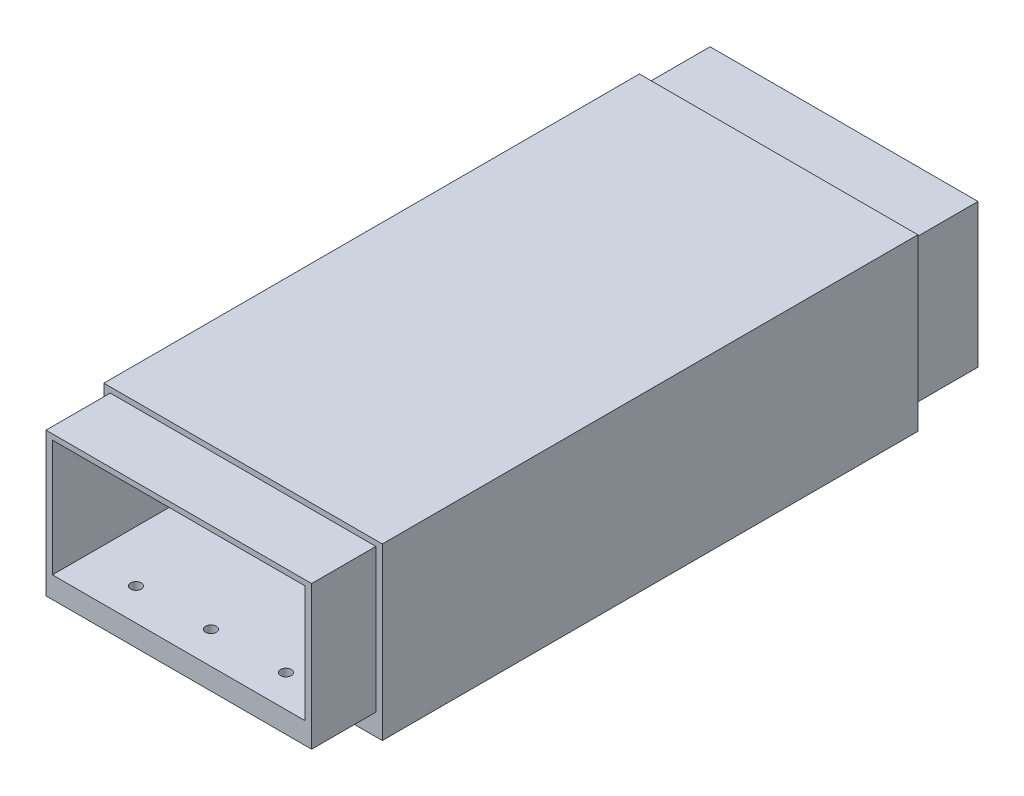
ISO-10303-21;
HEADER;
FILE_DESCRIPTION(('STEP AP214'),'2;1');
FILE_NAME('part.step','',(''),(''),'','','');
FILE_SCHEMA(('AUTOMOTIVE_DESIGN { 1 0 10303 214 1 1 1 1 }'));
ENDSEC;
DATA;
#1=APPLICATION_CONTEXT('core data for automotive mechanical design processes');
#2=APPLICATION_PROTOCOL_DEFINITION('international standard','automotive_design',2000,#1);
#3=PRODUCT_CONTEXT('',#1,'mechanical');
#4=PRODUCT('Part','Part','',(#3));
#5=PRODUCT_RELATED_PRODUCT_CATEGORY('part','',(#4));
#6=PRODUCT_DEFINITION_FORMATION('','',#4);
#7=PRODUCT_DEFINITION_CONTEXT('part definition',#1,'design');
#8=PRODUCT_DEFINITION('design','',#6,#7);
#9=PRODUCT_DEFINITION_SHAPE('','',#8);
#10=(LENGTH_UNIT() NAMED_UNIT(*) SI_UNIT(.MILLI.,.METRE.));
#11=(NAMED_UNIT(*) PLANE_ANGLE_UNIT() SI_UNIT($,.RADIAN.));
#12=(NAMED_UNIT(*) SI_UNIT($,.STERADIAN.) SOLID_ANGLE_UNIT());
#13=UNCERTAINTY_MEASURE_WITH_UNIT(LENGTH_MEASURE(1.E-05),#10,'distance_accuracy_value','');
#14=(GEOMETRIC_REPRESENTATION_CONTEXT(3) GLOBAL_UNCERTAINTY_ASSIGNED_CONTEXT((#13)) GLOBAL_UNIT_ASSIGNED_CONTEXT((#10,
#11,#12)) REPRESENTATION_CONTEXT('',''));
#15=CARTESIAN_POINT('',(0.,0.,0.));
#16=DIRECTION('',(0.,0.,1.));
#17=DIRECTION('',(1.,0.,0.));
#18=AXIS2_PLACEMENT_3D('',#15,#16,#17);
#19=CARTESIAN_POINT('',(0.,0.,1680.00000000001));
#20=DIRECTION('',(0.,0.,-1.));
#21=DIRECTION('',(-1.,0.,0.));
#22=AXIS2_PLACEMENT_3D('',#19,#20,#21);
#23=PLANE('',#22);
#24=DIRECTION('',(0.,-1.,0.));
#25=VECTOR('',#24,1.);
#26=CARTESIAN_POINT('',(-122.30239365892,63.0246653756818,1680.00000000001));
#27=LINE('',#26,#25);
#28=CARTESIAN_POINT('',(-122.30239365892,142.51739571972,1680.00000000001));
#29=VERTEX_POINT('',#28);
#30=CARTESIAN_POINT('',(-122.30239365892,63.0246653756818,1680.00000000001));
#31=VERTEX_POINT('',#30);
#32=EDGE_CURVE('E210',#29,#31,#27,.T.);
#33=ORIENTED_EDGE('',*,*,#32,.T.);
#34=DIRECTION('',(1.,0.,0.));
#35=VECTOR('',#34,1.);
#36=CARTESIAN_POINT('',(-122.30239365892,63.0246653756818,1680.00000000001));
#37=LINE('',#36,#35);
#38=CARTESIAN_POINT('',(7.69760634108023,63.0246653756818,1680.00000000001));
#39=VERTEX_POINT('',#38);
#40=EDGE_CURVE('E213',#31,#39,#37,.T.);
#41=ORIENTED_EDGE('',*,*,#40,.T.);
#42=DIRECTION('',(0.,1.,0.));
#43=VECTOR('',#42,1.);
#44=CARTESIAN_POINT('',(7.69760634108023,63.0246653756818,1680.00000000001));
#45=LINE('',#44,#43);
#46=CARTESIAN_POINT('',(7.69760634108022,142.51739571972,1680.00000000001));
#47=VERTEX_POINT('',#46);
#48=EDGE_CURVE('E216',#39,#47,#45,.T.);
#49=ORIENTED_EDGE('',*,*,#48,.T.);
#50=DIRECTION('',(-1.,0.,0.));
#51=VECTOR('',#50,1.);
#52=CARTESIAN_POINT('',(-122.30239365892,142.51739571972,1680.00000000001));
#53=LINE('',#52,#51);
#54=EDGE_CURVE('E218',#47,#29,#53,.T.);
#55=ORIENTED_EDGE('',*,*,#54,.T.);
#56=EDGE_LOOP('',(#33,#41,#49,#55));
#57=FACE_BOUND('',#56,.T.);
#58=DIRECTION('',(0.,-1.,0.));
#59=VECTOR('',#58,1.);
#60=CARTESIAN_POINT('',(-119.30239365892,140.01739571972,1680.00000000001));
#61=LINE('',#60,#59);
#62=CARTESIAN_POINT('',(-119.30239365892,140.01739571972,1680.00000000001));
#63=VERTEX_POINT('',#62);
#64=CARTESIAN_POINT('',(-119.30239365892,73.0246653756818,1680.00000000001));
#65=VERTEX_POINT('',#64);
#66=EDGE_CURVE('E54',#63,#65,#61,.T.);
#67=ORIENTED_EDGE('',*,*,#66,.F.);
#68=DIRECTION('',(-1.,0.,0.));
#69=VECTOR('',#68,1.);
#70=CARTESIAN_POINT('',(-119.30239365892,140.01739571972,1680.00000000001));
#71=LINE('',#70,#69);
#72=CARTESIAN_POINT('',(4.69760634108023,140.01739571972,1680.00000000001));
#73=VERTEX_POINT('',#72);
#74=EDGE_CURVE('E58',#73,#63,#71,.T.);
#75=ORIENTED_EDGE('',*,*,#74,.F.);
#76=DIRECTION('',(0.,1.,0.));
#77=VECTOR('',#76,1.);
#78=CARTESIAN_POINT('',(4.69760634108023,140.01739571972,1680.00000000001));
#79=LINE('',#78,#77);
#80=CARTESIAN_POINT('',(4.69760634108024,73.0246653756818,1680.00000000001));
#81=VERTEX_POINT('',#80);
#82=EDGE_CURVE('E195',#81,#73,#79,.T.);
#83=ORIENTED_EDGE('',*,*,#82,.F.);
#84=DIRECTION('',(1.,0.,0.));
#85=VECTOR('',#84,1.);
#86=CARTESIAN_POINT('',(-119.30239365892,73.0246653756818,1680.00000000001));
#87=LINE('',#86,#85);
#88=EDGE_CURVE('E192',#65,#81,#87,.T.);
#89=ORIENTED_EDGE('',*,*,#88,.F.);
#90=EDGE_LOOP('',(#67,#75,#83,#89));
#91=FACE_BOUND('',#90,.T.);
#92=ADVANCED_FACE('F39',(#57,#91),#23,.F.);
#93=CARTESIAN_POINT('',(-119.30239365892,140.01739571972,1571.88680099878));
#94=DIRECTION('',(0.,-1.,0.));
#95=DIRECTION('',(0.,0.,-1.));
#96=AXIS2_PLACEMENT_3D('',#93,#94,#95);
#97=PLANE('',#96);
#98=DIRECTION('',(-1.,0.,0.));
#99=VECTOR('',#98,1.);
#100=CARTESIAN_POINT('',(-119.30239365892,140.01739571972,1430.00000000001));
#101=LINE('',#100,#99);
#102=CARTESIAN_POINT('',(5.77293715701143,140.01739571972,1430.00000000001));
#103=VERTEX_POINT('',#102);
#104=CARTESIAN_POINT('',(-119.30239365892,140.01739571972,1430.00000000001));
#105=VERTEX_POINT('',#104);
#106=EDGE_CURVE('E239',#103,#105,#101,.T.);
#107=ORIENTED_EDGE('',*,*,#106,.F.);
#108=DIRECTION('',(0.,0.,-1.));
#109=VECTOR('',#108,1.);
#110=CARTESIAN_POINT('',(5.77293715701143,140.01739571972,1571.88680099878));
#111=LINE('',#110,#109);
#112=CARTESIAN_POINT('',(5.77293715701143,140.01739571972,1400.00000000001));
#113=VERTEX_POINT('',#112);
#114=EDGE_CURVE('E277',#103,#113,#111,.T.);
#115=ORIENTED_EDGE('',*,*,#114,.T.);
#116=DIRECTION('',(-1.,0.,0.));
#117=VECTOR('',#116,1.);
#118=CARTESIAN_POINT('',(-119.30239365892,140.01739571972,1400.00000000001));
#119=LINE('',#118,#117);
#120=CARTESIAN_POINT('',(-119.30239365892,140.01739571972,1400.00000000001));
#121=VERTEX_POINT('',#120);
#122=EDGE_CURVE('E272',#113,#121,#119,.T.);
#123=ORIENTED_EDGE('',*,*,#122,.T.);
#124=DIRECTION('',(0.,0.,-1.));
#125=VECTOR('',#124,1.);
#126=CARTESIAN_POINT('',(-119.30239365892,140.01739571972,1571.88680099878));
#127=LINE('',#126,#125);
#128=EDGE_CURVE('E275',#105,#121,#127,.T.);
#129=ORIENTED_EDGE('',*,*,#128,.F.);
#130=EDGE_LOOP('',(#107,#115,#123,#129));
#131=FACE_BOUND('',#130,.T.);
#132=ADVANCED_FACE('F293',(#131),#97,.F.);
#133=CARTESIAN_POINT('',(5.77293715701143,140.01739571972,1571.88680099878));
#134=DIRECTION('',(-1.,0.,0.));
#135=DIRECTION('',(0.,-1.,0.));
#136=AXIS2_PLACEMENT_3D('',#133,#134,#135);
#137=PLANE('',#136);
#138=DIRECTION('',(0.,1.,0.));
#139=VECTOR('',#138,1.);
#140=CARTESIAN_POINT('',(5.77293715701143,140.01739571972,1430.00000000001));
#141=LINE('',#140,#139);
#142=CARTESIAN_POINT('',(5.77293715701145,73.0246653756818,1430.00000000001));
#143=VERTEX_POINT('',#142);
#144=EDGE_CURVE('E242',#143,#103,#141,.T.);
#145=ORIENTED_EDGE('',*,*,#144,.F.);
#146=DIRECTION('',(0.,0.,-1.));
#147=VECTOR('',#146,1.);
#148=CARTESIAN_POINT('',(5.77293715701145,73.0246653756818,1571.88680099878));
#149=LINE('',#148,#147);
#150=CARTESIAN_POINT('',(5.77293715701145,73.0246653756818,1400.00000000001));
#151=VERTEX_POINT('',#150);
#152=EDGE_CURVE('E47',#143,#151,#149,.T.);
#153=ORIENTED_EDGE('',*,*,#152,.T.);
#154=DIRECTION('',(0.,1.,0.));
#155=VECTOR('',#154,1.);
#156=CARTESIAN_POINT('',(5.77293715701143,140.01739571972,1400.00000000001));
#157=LINE('',#156,#155);
#158=EDGE_CURVE('E269',#151,#113,#157,.T.);
#159=ORIENTED_EDGE('',*,*,#158,.T.);
#160=ORIENTED_EDGE('',*,*,#114,.F.);
#161=EDGE_LOOP('',(#145,#153,#159,#160));
#162=FACE_BOUND('',#161,.T.);
#163=ADVANCED_FACE('F280',(#162),#137,.F.);
#164=CARTESIAN_POINT('',(-119.30239365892,73.0246653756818,1571.88680099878));
#165=DIRECTION('',(0.,1.,0.));
#166=DIRECTION('',(0.,0.,1.));
#167=AXIS2_PLACEMENT_3D('',#164,#165,#166);
#168=PLANE('',#167);
#169=CARTESIAN_POINT('',(-92.3023936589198,73.0246653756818,1415.00000000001));
#170=DIRECTION('',(0.,-1.,0.));
#171=DIRECTION('',(0.,0.,-1.));
#172=AXIS2_PLACEMENT_3D('',#169,#170,#171);
#173=CIRCLE('',#172,2.49999999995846);
#174=CARTESIAN_POINT('',(-92.3023936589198,73.0246653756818,1412.50000000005));
#175=VERTEX_POINT('',#174);
#176=EDGE_CURVE('E170',#175,#175,#173,.T.);
#177=ORIENTED_EDGE('',*,*,#176,.F.);
#178=EDGE_LOOP('',(#177));
#179=FACE_BOUND('',#178,.T.);
#180=CARTESIAN_POINT('',(-57.3023936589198,73.0246653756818,1415.00000000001));
#181=DIRECTION('',(0.,-1.,0.));
#182=DIRECTION('',(0.,0.,-1.));
#183=AXIS2_PLACEMENT_3D('',#180,#181,#182);
#184=CIRCLE('',#183,2.49999999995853);
#185=CARTESIAN_POINT('',(-57.3023936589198,73.0246653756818,1412.50000000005));
#186=VERTEX_POINT('',#185);
#187=EDGE_CURVE('E598',#186,#186,#184,.T.);
#188=ORIENTED_EDGE('',*,*,#187,.F.);
#189=EDGE_LOOP('',(#188));
#190=FACE_BOUND('',#189,.T.);
#191=CARTESIAN_POINT('',(-22.3023936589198,73.0246653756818,1415.00000000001));
#192=DIRECTION('',(0.,-1.,0.));
#193=DIRECTION('',(0.,0.,-1.));
#194=AXIS2_PLACEMENT_3D('',#191,#192,#193);
#195=CIRCLE('',#194,2.49999999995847);
#196=CARTESIAN_POINT('',(-22.3023936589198,73.0246653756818,1412.50000000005));
#197=VERTEX_POINT('',#196);
#198=EDGE_CURVE('E572',#197,#197,#195,.T.);
#199=ORIENTED_EDGE('',*,*,#198,.F.);
#200=EDGE_LOOP('',(#199));
#201=FACE_BOUND('',#200,.T.);
#202=DIRECTION('',(1.,0.,0.));
#203=VECTOR('',#202,1.);
#204=CARTESIAN_POINT('',(-119.30239365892,73.0246653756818,1430.00000000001));
#205=LINE('',#204,#203);
#206=CARTESIAN_POINT('',(-119.30239365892,73.0246653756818,1430.00000000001));
#207=VERTEX_POINT('',#206);
#208=EDGE_CURVE('E245',#207,#143,#205,.T.);
#209=ORIENTED_EDGE('',*,*,#208,.F.);
#210=DIRECTION('',(0.,0.,-1.));
#211=VECTOR('',#210,1.);
#212=CARTESIAN_POINT('',(-119.30239365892,73.0246653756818,1571.88680099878));
#213=LINE('',#212,#211);
#214=CARTESIAN_POINT('',(-119.30239365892,73.0246653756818,1400.00000000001));
#215=VERTEX_POINT('',#214);
#216=EDGE_CURVE('E11',#207,#215,#213,.T.);
#217=ORIENTED_EDGE('',*,*,#216,.T.);
#218=DIRECTION('',(1.,0.,0.));
#219=VECTOR('',#218,1.);
#220=CARTESIAN_POINT('',(-119.30239365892,73.0246653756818,1400.00000000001));
#221=LINE('',#220,#219);
#222=EDGE_CURVE('E266',#215,#151,#221,.T.);
#223=ORIENTED_EDGE('',*,*,#222,.T.);
#224=ORIENTED_EDGE('',*,*,#152,.F.);
#225=EDGE_LOOP('',(#209,#217,#223,#224));
#226=FACE_BOUND('',#225,.T.);
#227=ADVANCED_FACE('F286',(#179,#190,#201,#226),#168,.F.);
#228=CARTESIAN_POINT('',(-119.30239365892,140.01739571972,1571.88680099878));
#229=DIRECTION('',(1.,0.,0.));
#230=DIRECTION('',(0.,1.,0.));
#231=AXIS2_PLACEMENT_3D('',#228,#229,#230);
#232=PLANE('',#231);
#233=DIRECTION('',(0.,-1.,0.));
#234=VECTOR('',#233,1.);
#235=CARTESIAN_POINT('',(-119.30239365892,140.01739571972,1430.00000000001));
#236=LINE('',#235,#234);
#237=EDGE_CURVE('E248',#105,#207,#236,.T.);
#238=ORIENTED_EDGE('',*,*,#237,.F.);
#239=ORIENTED_EDGE('',*,*,#128,.T.);
#240=DIRECTION('',(0.,-1.,0.));
#241=VECTOR('',#240,1.);
#242=CARTESIAN_POINT('',(-119.30239365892,140.01739571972,1400.00000000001));
#243=LINE('',#242,#241);
#244=EDGE_CURVE('E160',#121,#215,#243,.T.);
#245=ORIENTED_EDGE('',*,*,#244,.T.);
#246=ORIENTED_EDGE('',*,*,#216,.F.);
#247=EDGE_LOOP('',(#238,#239,#245,#246));
#248=FACE_BOUND('',#247,.T.);
#249=ADVANCED_FACE('F41',(#248),#232,.F.);
#250=CARTESIAN_POINT('',(0.,0.,1400.00000000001));
#251=DIRECTION('',(0.,0.,1.));
#252=DIRECTION('',(1.,0.,0.));
#253=AXIS2_PLACEMENT_3D('',#250,#251,#252);
#254=PLANE('',#253);
#255=ORIENTED_EDGE('',*,*,#244,.F.);
#256=ORIENTED_EDGE('',*,*,#122,.F.);
#257=ORIENTED_EDGE('',*,*,#158,.F.);
#258=ORIENTED_EDGE('',*,*,#222,.F.);
#259=EDGE_LOOP('',(#255,#256,#257,#258));
#260=FACE_BOUND('',#259,.T.);
#261=DIRECTION('',(0.,-1.,0.));
#262=VECTOR('',#261,1.);
#263=CARTESIAN_POINT('',(-116.30239365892,137.51739571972,1400.00000000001));
#264=LINE('',#263,#262);
#265=CARTESIAN_POINT('',(-116.30239365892,137.51739571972,1400.00000000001));
#266=VERTEX_POINT('',#265);
#267=CARTESIAN_POINT('',(-116.30239365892,83.0246653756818,1400.00000000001));
#268=VERTEX_POINT('',#267);
#269=EDGE_CURVE('E251',#266,#268,#264,.T.);
#270=ORIENTED_EDGE('',*,*,#269,.T.);
#271=DIRECTION('',(1.,0.,0.));
#272=VECTOR('',#271,1.);
#273=CARTESIAN_POINT('',(-116.30239365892,83.0246653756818,1400.00000000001));
#274=LINE('',#273,#272);
#275=CARTESIAN_POINT('',(1.69760634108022,83.0246653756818,1400.00000000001));
#276=VERTEX_POINT('',#275);
#277=EDGE_CURVE('E156',#268,#276,#274,.T.);
#278=ORIENTED_EDGE('',*,*,#277,.T.);
#279=DIRECTION('',(0.,1.,0.));
#280=VECTOR('',#279,1.);
#281=CARTESIAN_POINT('',(1.69760634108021,137.51739571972,1400.00000000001));
#282=LINE('',#281,#280);
#283=CARTESIAN_POINT('',(1.69760634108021,137.51739571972,1400.00000000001));
#284=VERTEX_POINT('',#283);
#285=EDGE_CURVE('E254',#276,#284,#282,.T.);
#286=ORIENTED_EDGE('',*,*,#285,.T.);
#287=DIRECTION('',(-1.,0.,0.));
#288=VECTOR('',#287,1.);
#289=CARTESIAN_POINT('',(-116.30239365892,137.51739571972,1400.00000000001));
#290=LINE('',#289,#288);
#291=EDGE_CURVE('E257',#284,#266,#290,.T.);
#292=ORIENTED_EDGE('',*,*,#291,.T.);
#293=EDGE_LOOP('',(#270,#278,#286,#292));
#294=FACE_BOUND('',#293,.T.);
#295=ADVANCED_FACE('F290',(#260,#294),#254,.F.);
#296=CARTESIAN_POINT('',(-116.30239365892,137.51739571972,1571.88680099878));
#297=DIRECTION('',(0.,-1.,0.));
#298=DIRECTION('',(0.,0.,-1.));
#299=AXIS2_PLACEMENT_3D('',#296,#297,#298);
#300=PLANE('',#299);
#301=DIRECTION('',(0.,0.,-1.));
#302=VECTOR('',#301,1.);
#303=CARTESIAN_POINT('',(1.69760634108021,137.51739571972,1571.88680099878));
#304=LINE('',#303,#302);
#305=CARTESIAN_POINT('',(1.6976063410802,137.51739571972,1710.00000000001));
#306=VERTEX_POINT('',#305);
#307=EDGE_CURVE('E261',#306,#284,#304,.T.);
#308=ORIENTED_EDGE('',*,*,#307,.F.);
#309=DIRECTION('',(-1.,0.,0.));
#310=VECTOR('',#309,1.);
#311=CARTESIAN_POINT('',(-116.30239365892,137.51739571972,1710.00000000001));
#312=LINE('',#311,#310);
#313=CARTESIAN_POINT('',(-116.30239365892,137.51739571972,1710.00000000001));
#314=VERTEX_POINT('',#313);
#315=EDGE_CURVE('E176',#306,#314,#312,.T.);
#316=ORIENTED_EDGE('',*,*,#315,.T.);
#317=DIRECTION('',(0.,0.,-1.));
#318=VECTOR('',#317,1.);
#319=CARTESIAN_POINT('',(-116.30239365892,137.51739571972,1571.88680099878));
#320=LINE('',#319,#318);
#321=EDGE_CURVE('E166',#314,#266,#320,.T.);
#322=ORIENTED_EDGE('',*,*,#321,.T.);
#323=ORIENTED_EDGE('',*,*,#291,.F.);
#324=EDGE_LOOP('',(#308,#316,#322,#323));
#325=FACE_BOUND('',#324,.T.);
#326=ADVANCED_FACE('F305',(#325),#300,.T.);
#327=CARTESIAN_POINT('',(1.69760634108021,137.51739571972,1571.88680099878));
#328=DIRECTION('',(-1.,0.,0.));
#329=DIRECTION('',(0.,-1.,0.));
#330=AXIS2_PLACEMENT_3D('',#327,#328,#329);
#331=PLANE('',#330);
#332=DIRECTION('',(0.,0.,-1.));
#333=VECTOR('',#332,1.);
#334=CARTESIAN_POINT('',(1.69760634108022,83.0246653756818,1571.88680099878));
#335=LINE('',#334,#333);
#336=CARTESIAN_POINT('',(1.6976063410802,83.0246653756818,1710.00000000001));
#337=VERTEX_POINT('',#336);
#338=EDGE_CURVE('E161',#337,#276,#335,.T.);
#339=ORIENTED_EDGE('',*,*,#338,.F.);
#340=DIRECTION('',(0.,1.,0.));
#341=VECTOR('',#340,1.);
#342=CARTESIAN_POINT('',(1.6976063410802,137.51739571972,1710.00000000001));
#343=LINE('',#342,#341);
#344=EDGE_CURVE('E174',#337,#306,#343,.T.);
#345=ORIENTED_EDGE('',*,*,#344,.T.);
#346=ORIENTED_EDGE('',*,*,#307,.T.);
#347=ORIENTED_EDGE('',*,*,#285,.F.);
#348=EDGE_LOOP('',(#339,#345,#346,#347));
#349=FACE_BOUND('',#348,.T.);
#350=ADVANCED_FACE('F339',(#349),#331,.T.);
#351=CARTESIAN_POINT('',(-116.30239365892,83.0246653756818,1571.88680099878));
#352=DIRECTION('',(0.,1.,0.));
#353=DIRECTION('',(0.,0.,1.));
#354=AXIS2_PLACEMENT_3D('',#351,#352,#353);
#355=PLANE('',#354);
#356=CARTESIAN_POINT('',(-92.3023936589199,83.0246653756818,1695.00000000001));
#357=DIRECTION('',(0.,1.,0.));
#358=DIRECTION('',(0.,0.,1.));
#359=AXIS2_PLACEMENT_3D('',#356,#357,#358);
#360=CIRCLE('',#359,2.49999999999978);
#361=CARTESIAN_POINT('',(-92.3023936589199,83.0246653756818,1697.50000000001));
#362=VERTEX_POINT('',#361);
#363=EDGE_CURVE('E568',#362,#362,#360,.F.);
#364=ORIENTED_EDGE('',*,*,#363,.T.);
#365=EDGE_LOOP('',(#364));
#366=FACE_BOUND('',#365,.T.);
#367=CARTESIAN_POINT('',(-57.3023936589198,83.0246653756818,1695.00000000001));
#368=DIRECTION('',(0.,1.,0.));
#369=DIRECTION('',(0.,0.,1.));
#370=AXIS2_PLACEMENT_3D('',#367,#368,#369);
#371=CIRCLE('',#370,2.50000000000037);
#372=CARTESIAN_POINT('',(-57.3023936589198,83.0246653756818,1697.50000000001));
#373=VERTEX_POINT('',#372);
#374=EDGE_CURVE('E576',#373,#373,#371,.F.);
#375=ORIENTED_EDGE('',*,*,#374,.T.);
#376=EDGE_LOOP('',(#375));
#377=FACE_BOUND('',#376,.T.);
#378=CARTESIAN_POINT('',(-22.3023936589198,83.0246653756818,1695.00000000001));
#379=DIRECTION('',(0.,1.,0.));
#380=DIRECTION('',(0.,0.,1.));
#381=AXIS2_PLACEMENT_3D('',#378,#379,#380);
#382=CIRCLE('',#381,2.49999999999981);
#383=CARTESIAN_POINT('',(-22.3023936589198,83.0246653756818,1697.50000000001));
#384=VERTEX_POINT('',#383);
#385=EDGE_CURVE('E582',#384,#384,#382,.F.);
#386=ORIENTED_EDGE('',*,*,#385,.T.);
#387=EDGE_LOOP('',(#386));
#388=FACE_BOUND('',#387,.T.);
#389=CARTESIAN_POINT('',(-92.3023936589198,83.0246653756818,1415.00000000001));
#390=DIRECTION('',(0.,1.,0.));
#391=DIRECTION('',(0.,0.,1.));
#392=AXIS2_PLACEMENT_3D('',#389,#390,#391);
#393=CIRCLE('',#392,2.49999999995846);
#394=CARTESIAN_POINT('',(-92.3023936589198,83.0246653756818,1417.49999999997));
#395=VERTEX_POINT('',#394);
#396=EDGE_CURVE('E592',#395,#395,#393,.F.);
#397=ORIENTED_EDGE('',*,*,#396,.T.);
#398=EDGE_LOOP('',(#397));
#399=FACE_BOUND('',#398,.T.);
#400=CARTESIAN_POINT('',(-57.3023936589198,83.0246653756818,1415.00000000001));
#401=DIRECTION('',(0.,1.,0.));
#402=DIRECTION('',(0.,0.,1.));
#403=AXIS2_PLACEMENT_3D('',#400,#401,#402);
#404=CIRCLE('',#403,2.49999999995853);
#405=CARTESIAN_POINT('',(-57.3023936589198,83.0246653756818,1417.49999999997));
#406=VERTEX_POINT('',#405);
#407=EDGE_CURVE('E595',#406,#406,#404,.F.);
#408=ORIENTED_EDGE('',*,*,#407,.T.);
#409=EDGE_LOOP('',(#408));
#410=FACE_BOUND('',#409,.T.);
#411=CARTESIAN_POINT('',(-22.3023936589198,83.0246653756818,1415.00000000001));
#412=DIRECTION('',(0.,1.,0.));
#413=DIRECTION('',(0.,0.,1.));
#414=AXIS2_PLACEMENT_3D('',#411,#412,#413);
#415=CIRCLE('',#414,2.49999999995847);
#416=CARTESIAN_POINT('',(-22.3023936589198,83.0246653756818,1417.49999999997));
#417=VERTEX_POINT('',#416);
#418=EDGE_CURVE('E575',#417,#417,#415,.F.);
#419=ORIENTED_EDGE('',*,*,#418,.T.);
#420=EDGE_LOOP('',(#419));
#421=FACE_BOUND('',#420,.T.);
#422=DIRECTION('',(0.,0.,-1.));
#423=VECTOR('',#422,1.);
#424=CARTESIAN_POINT('',(-116.30239365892,83.0246653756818,1571.88680099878));
#425=LINE('',#424,#423);
#426=CARTESIAN_POINT('',(-116.30239365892,83.0246653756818,1710.00000000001));
#427=VERTEX_POINT('',#426);
#428=EDGE_CURVE('E149',#427,#268,#425,.T.);
#429=ORIENTED_EDGE('',*,*,#428,.F.);
#430=DIRECTION('',(1.,0.,0.));
#431=VECTOR('',#430,1.);
#432=CARTESIAN_POINT('',(-116.30239365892,83.0246653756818,1710.00000000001));
#433=LINE('',#432,#431);
#434=EDGE_CURVE('E153',#427,#337,#433,.T.);
#435=ORIENTED_EDGE('',*,*,#434,.T.);
#436=ORIENTED_EDGE('',*,*,#338,.T.);
#437=ORIENTED_EDGE('',*,*,#277,.F.);
#438=EDGE_LOOP('',(#429,#435,#436,#437));
#439=FACE_BOUND('',#438,.T.);
#440=ADVANCED_FACE('F151',(#366,#377,#388,#399,#410,#421,#439),#355,.T.);
#441=CARTESIAN_POINT('',(-116.30239365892,137.51739571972,1571.88680099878));
#442=DIRECTION('',(1.,0.,0.));
#443=DIRECTION('',(0.,0.,-1.));
#444=AXIS2_PLACEMENT_3D('',#441,#442,#443);
#445=PLANE('',#444);
#446=ORIENTED_EDGE('',*,*,#321,.F.);
#447=DIRECTION('',(0.,-1.,0.));
#448=VECTOR('',#447,1.);
#449=CARTESIAN_POINT('',(-116.30239365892,137.51739571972,1710.00000000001));
#450=LINE('',#449,#448);
#451=EDGE_CURVE('E164',#314,#427,#450,.T.);
#452=ORIENTED_EDGE('',*,*,#451,.T.);
#453=ORIENTED_EDGE('',*,*,#428,.T.);
#454=ORIENTED_EDGE('',*,*,#269,.F.);
#455=EDGE_LOOP('',(#446,#452,#453,#454));
#456=FACE_BOUND('',#455,.T.);
#457=ADVANCED_FACE('F165',(#456),#445,.T.);
#458=CARTESIAN_POINT('',(0.,0.,1430.00000000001));
#459=DIRECTION('',(0.,0.,-1.));
#460=DIRECTION('',(-1.,0.,0.));
#461=AXIS2_PLACEMENT_3D('',#458,#459,#460);
#462=PLANE('',#461);
#463=ORIENTED_EDGE('',*,*,#144,.T.);
#464=ORIENTED_EDGE('',*,*,#106,.T.);
#465=ORIENTED_EDGE('',*,*,#237,.T.);
#466=ORIENTED_EDGE('',*,*,#208,.T.);
#467=EDGE_LOOP('',(#463,#464,#465,#466));
#468=FACE_BOUND('',#467,.T.);
#469=DIRECTION('',(0.,-1.,0.));
#470=VECTOR('',#469,1.);
#471=CARTESIAN_POINT('',(-122.30239365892,63.0246653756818,1430.00000000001));
#472=LINE('',#471,#470);
#473=CARTESIAN_POINT('',(-122.30239365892,142.51739571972,1430.00000000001));
#474=VERTEX_POINT('',#473);
#475=CARTESIAN_POINT('',(-122.30239365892,63.0246653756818,1430.00000000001));
#476=VERTEX_POINT('',#475);
#477=EDGE_CURVE('E209',#474,#476,#472,.T.);
#478=ORIENTED_EDGE('',*,*,#477,.F.);
#479=DIRECTION('',(-1.,0.,0.));
#480=VECTOR('',#479,1.);
#481=CARTESIAN_POINT('',(-122.30239365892,142.51739571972,1430.00000000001));
#482=LINE('',#481,#480);
#483=CARTESIAN_POINT('',(7.69760634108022,142.51739571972,1430.00000000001));
#484=VERTEX_POINT('',#483);
#485=EDGE_CURVE('E214',#484,#474,#482,.T.);
#486=ORIENTED_EDGE('',*,*,#485,.F.);
#487=DIRECTION('',(0.,1.,0.));
#488=VECTOR('',#487,1.);
#489=CARTESIAN_POINT('',(7.69760634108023,63.0246653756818,1430.00000000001));
#490=LINE('',#489,#488);
#491=CARTESIAN_POINT('',(7.69760634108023,63.0246653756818,1430.00000000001));
#492=VERTEX_POINT('',#491);
#493=EDGE_CURVE('E225',#492,#484,#490,.T.);
#494=ORIENTED_EDGE('',*,*,#493,.F.);
#495=DIRECTION('',(1.,0.,0.));
#496=VECTOR('',#495,1.);
#497=CARTESIAN_POINT('',(-122.30239365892,63.0246653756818,1430.00000000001));
#498=LINE('',#497,#496);
#499=EDGE_CURVE('E223',#476,#492,#498,.T.);
#500=ORIENTED_EDGE('',*,*,#499,.F.);
#501=EDGE_LOOP('',(#478,#486,#494,#500));
#502=FACE_BOUND('',#501,.T.);
#503=ADVANCED_FACE('F296',(#468,#502),#462,.T.);
#504=CARTESIAN_POINT('',(-122.30239365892,142.51739571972,1680.00000000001));
#505=DIRECTION('',(0.,-1.,0.));
#506=DIRECTION('',(0.,0.,-1.));
#507=AXIS2_PLACEMENT_3D('',#504,#505,#506);
#508=PLANE('',#507);
#509=ORIENTED_EDGE('',*,*,#485,.T.);
#510=DIRECTION('',(0.,0.,-1.));
#511=VECTOR('',#510,1.);
#512=CARTESIAN_POINT('',(-122.30239365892,142.51739571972,1680.00000000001));
#513=LINE('',#512,#511);
#514=EDGE_CURVE('E220',#29,#474,#513,.T.);
#515=ORIENTED_EDGE('',*,*,#514,.F.);
#516=ORIENTED_EDGE('',*,*,#54,.F.);
#517=DIRECTION('',(0.,0.,-1.));
#518=VECTOR('',#517,1.);
#519=CARTESIAN_POINT('',(7.69760634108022,142.51739571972,1680.00000000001));
#520=LINE('',#519,#518);
#521=EDGE_CURVE('E230',#47,#484,#520,.T.);
#522=ORIENTED_EDGE('',*,*,#521,.T.);
#523=EDGE_LOOP('',(#509,#515,#516,#522));
#524=FACE_BOUND('',#523,.T.);
#525=ADVANCED_FACE('F323',(#524),#508,.F.);
#526=CARTESIAN_POINT('',(7.69760634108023,63.0246653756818,1680.00000000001));
#527=DIRECTION('',(-1.,0.,0.));
#528=DIRECTION('',(0.,-1.,0.));
#529=AXIS2_PLACEMENT_3D('',#526,#527,#528);
#530=PLANE('',#529);
#531=ORIENTED_EDGE('',*,*,#493,.T.);
#532=ORIENTED_EDGE('',*,*,#521,.F.);
#533=ORIENTED_EDGE('',*,*,#48,.F.);
#534=DIRECTION('',(0.,0.,-1.));
#535=VECTOR('',#534,1.);
#536=CARTESIAN_POINT('',(7.69760634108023,63.0246653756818,1680.00000000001));
#537=LINE('',#536,#535);
#538=EDGE_CURVE('E233',#39,#492,#537,.T.);
#539=ORIENTED_EDGE('',*,*,#538,.T.);
#540=EDGE_LOOP('',(#531,#532,#533,#539));
#541=FACE_BOUND('',#540,.T.);
#542=ADVANCED_FACE('F326',(#541),#530,.F.);
#543=CARTESIAN_POINT('',(-122.30239365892,63.0246653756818,1680.00000000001));
#544=DIRECTION('',(0.,1.,0.));
#545=DIRECTION('',(0.,0.,1.));
#546=AXIS2_PLACEMENT_3D('',#543,#544,#545);
#547=PLANE('',#546);
#548=ORIENTED_EDGE('',*,*,#499,.T.);
#549=ORIENTED_EDGE('',*,*,#538,.F.);
#550=ORIENTED_EDGE('',*,*,#40,.F.);
#551=DIRECTION('',(0.,0.,-1.));
#552=VECTOR('',#551,1.);
#553=CARTESIAN_POINT('',(-122.30239365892,63.0246653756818,1680.00000000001));
#554=LINE('',#553,#552);
#555=EDGE_CURVE('E236',#31,#476,#554,.T.);
#556=ORIENTED_EDGE('',*,*,#555,.T.);
#557=EDGE_LOOP('',(#548,#549,#550,#556));
#558=FACE_BOUND('',#557,.T.);
#559=ADVANCED_FACE('F330',(#558),#547,.F.);
#560=CARTESIAN_POINT('',(-122.30239365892,63.0246653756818,1680.00000000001));
#561=DIRECTION('',(1.,0.,0.));
#562=DIRECTION('',(0.,1.,0.));
#563=AXIS2_PLACEMENT_3D('',#560,#561,#562);
#564=PLANE('',#563);
#565=ORIENTED_EDGE('',*,*,#477,.T.);
#566=ORIENTED_EDGE('',*,*,#555,.F.);
#567=ORIENTED_EDGE('',*,*,#32,.F.);
#568=ORIENTED_EDGE('',*,*,#514,.T.);
#569=EDGE_LOOP('',(#565,#566,#567,#568));
#570=FACE_BOUND('',#569,.T.);
#571=ADVANCED_FACE('F334',(#570),#564,.F.);
#572=CARTESIAN_POINT('',(0.,0.,1710.00000000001));
#573=DIRECTION('',(0.,0.,1.));
#574=DIRECTION('',(1.,0.,0.));
#575=AXIS2_PLACEMENT_3D('',#572,#573,#574);
#576=PLANE('',#575);
#577=DIRECTION('',(0.,-1.,0.));
#578=VECTOR('',#577,1.);
#579=CARTESIAN_POINT('',(-119.30239365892,140.01739571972,1710.00000000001));
#580=LINE('',#579,#578);
#581=CARTESIAN_POINT('',(-119.30239365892,140.01739571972,1710.00000000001));
#582=VERTEX_POINT('',#581);
#583=CARTESIAN_POINT('',(-119.30239365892,73.0246653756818,1710.00000000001));
#584=VERTEX_POINT('',#583);
#585=EDGE_CURVE('E181',#582,#584,#580,.T.);
#586=ORIENTED_EDGE('',*,*,#585,.T.);
#587=DIRECTION('',(1.,0.,0.));
#588=VECTOR('',#587,1.);
#589=CARTESIAN_POINT('',(-119.30239365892,73.0246653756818,1710.00000000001));
#590=LINE('',#589,#588);
#591=CARTESIAN_POINT('',(4.69760634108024,73.0246653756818,1710.00000000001));
#592=VERTEX_POINT('',#591);
#593=EDGE_CURVE('E184',#584,#592,#590,.T.);
#594=ORIENTED_EDGE('',*,*,#593,.T.);
#595=DIRECTION('',(0.,1.,0.));
#596=VECTOR('',#595,1.);
#597=CARTESIAN_POINT('',(4.69760634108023,140.01739571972,1710.00000000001));
#598=LINE('',#597,#596);
#599=CARTESIAN_POINT('',(4.69760634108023,140.01739571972,1710.00000000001));
#600=VERTEX_POINT('',#599);
#601=EDGE_CURVE('E186',#592,#600,#598,.T.);
#602=ORIENTED_EDGE('',*,*,#601,.T.);
#603=DIRECTION('',(-1.,0.,0.));
#604=VECTOR('',#603,1.);
#605=CARTESIAN_POINT('',(-119.30239365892,140.01739571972,1710.00000000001));
#606=LINE('',#605,#604);
#607=EDGE_CURVE('E188',#600,#582,#606,.T.);
#608=ORIENTED_EDGE('',*,*,#607,.T.);
#609=EDGE_LOOP('',(#586,#594,#602,#608));
#610=FACE_BOUND('',#609,.T.);
#611=ORIENTED_EDGE('',*,*,#434,.F.);
#612=ORIENTED_EDGE('',*,*,#451,.F.);
#613=ORIENTED_EDGE('',*,*,#315,.F.);
#614=ORIENTED_EDGE('',*,*,#344,.F.);
#615=EDGE_LOOP('',(#611,#612,#613,#614));
#616=FACE_BOUND('',#615,.T.);
#617=ADVANCED_FACE('F172',(#610,#616),#576,.T.);
#618=CARTESIAN_POINT('',(-119.30239365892,140.01739571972,1710.00000000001));
#619=DIRECTION('',(1.,0.,0.));
#620=DIRECTION('',(0.,1.,0.));
#621=AXIS2_PLACEMENT_3D('',#618,#619,#620);
#622=PLANE('',#621);
#623=ORIENTED_EDGE('',*,*,#66,.T.);
#624=DIRECTION('',(0.,0.,-1.));
#625=VECTOR('',#624,1.);
#626=CARTESIAN_POINT('',(-119.30239365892,73.0246653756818,1710.00000000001));
#627=LINE('',#626,#625);
#628=EDGE_CURVE('E206',#584,#65,#627,.T.);
#629=ORIENTED_EDGE('',*,*,#628,.F.);
#630=ORIENTED_EDGE('',*,*,#585,.F.);
#631=DIRECTION('',(0.,0.,-1.));
#632=VECTOR('',#631,1.);
#633=CARTESIAN_POINT('',(-119.30239365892,140.01739571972,1710.00000000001));
#634=LINE('',#633,#632);
#635=EDGE_CURVE('E190',#582,#63,#634,.T.);
#636=ORIENTED_EDGE('',*,*,#635,.T.);
#637=EDGE_LOOP('',(#623,#629,#630,#636));
#638=FACE_BOUND('',#637,.T.);
#639=ADVANCED_FACE('F320',(#638),#622,.F.);
#640=CARTESIAN_POINT('',(-119.30239365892,73.0246653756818,1710.00000000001));
#641=DIRECTION('',(0.,1.,0.));
#642=DIRECTION('',(0.,0.,1.));
#643=AXIS2_PLACEMENT_3D('',#640,#641,#642);
#644=PLANE('',#643);
#645=CARTESIAN_POINT('',(-92.3023936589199,73.0246653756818,1695.00000000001));
#646=DIRECTION('',(0.,-1.,0.));
#647=DIRECTION('',(0.,0.,-1.));
#648=AXIS2_PLACEMENT_3D('',#645,#646,#647);
#649=CIRCLE('',#648,2.49999999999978);
#650=CARTESIAN_POINT('',(-92.3023936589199,73.0246653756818,1692.50000000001));
#651=VERTEX_POINT('',#650);
#652=EDGE_CURVE('E571',#651,#651,#649,.T.);
#653=ORIENTED_EDGE('',*,*,#652,.F.);
#654=EDGE_LOOP('',(#653));
#655=FACE_BOUND('',#654,.T.);
#656=CARTESIAN_POINT('',(-57.3023936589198,73.0246653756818,1695.00000000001));
#657=DIRECTION('',(0.,-1.,0.));
#658=DIRECTION('',(0.,0.,-1.));
#659=AXIS2_PLACEMENT_3D('',#656,#657,#658);
#660=CIRCLE('',#659,2.50000000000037);
#661=CARTESIAN_POINT('',(-57.3023936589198,73.0246653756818,1692.50000000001));
#662=VERTEX_POINT('',#661);
#663=EDGE_CURVE('E579',#662,#662,#660,.T.);
#664=ORIENTED_EDGE('',*,*,#663,.F.);
#665=EDGE_LOOP('',(#664));
#666=FACE_BOUND('',#665,.T.);
#667=CARTESIAN_POINT('',(-22.3023936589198,73.0246653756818,1695.00000000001));
#668=DIRECTION('',(0.,-1.,0.));
#669=DIRECTION('',(0.,0.,-1.));
#670=AXIS2_PLACEMENT_3D('',#667,#668,#669);
#671=CIRCLE('',#670,2.49999999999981);
#672=CARTESIAN_POINT('',(-22.3023936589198,73.0246653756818,1692.50000000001));
#673=VERTEX_POINT('',#672);
#674=EDGE_CURVE('E585',#673,#673,#671,.T.);
#675=ORIENTED_EDGE('',*,*,#674,.F.);
#676=EDGE_LOOP('',(#675));
#677=FACE_BOUND('',#676,.T.);
#678=ORIENTED_EDGE('',*,*,#88,.T.);
#679=DIRECTION('',(0.,0.,-1.));
#680=VECTOR('',#679,1.);
#681=CARTESIAN_POINT('',(4.69760634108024,73.0246653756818,1710.00000000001));
#682=LINE('',#681,#680);
#683=EDGE_CURVE('E203',#592,#81,#682,.T.);
#684=ORIENTED_EDGE('',*,*,#683,.F.);
#685=ORIENTED_EDGE('',*,*,#593,.F.);
#686=ORIENTED_EDGE('',*,*,#628,.T.);
#687=EDGE_LOOP('',(#678,#684,#685,#686));
#688=FACE_BOUND('',#687,.T.);
#689=ADVANCED_FACE('F452',(#655,#666,#677,#688),#644,.F.);
#690=CARTESIAN_POINT('',(4.69760634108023,140.01739571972,1710.00000000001));
#691=DIRECTION('',(-1.,0.,0.));
#692=DIRECTION('',(0.,-1.,0.));
#693=AXIS2_PLACEMENT_3D('',#690,#691,#692);
#694=PLANE('',#693);
#695=ORIENTED_EDGE('',*,*,#82,.T.);
#696=DIRECTION('',(0.,0.,-1.));
#697=VECTOR('',#696,1.);
#698=CARTESIAN_POINT('',(4.69760634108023,140.01739571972,1710.00000000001));
#699=LINE('',#698,#697);
#700=EDGE_CURVE('E200',#600,#73,#699,.T.);
#701=ORIENTED_EDGE('',*,*,#700,.F.);
#702=ORIENTED_EDGE('',*,*,#601,.F.);
#703=ORIENTED_EDGE('',*,*,#683,.T.);
#704=EDGE_LOOP('',(#695,#701,#702,#703));
#705=FACE_BOUND('',#704,.T.);
#706=ADVANCED_FACE('F460',(#705),#694,.F.);
#707=CARTESIAN_POINT('',(-119.30239365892,140.01739571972,1710.00000000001));
#708=DIRECTION('',(0.,-1.,0.));
#709=DIRECTION('',(0.,0.,-1.));
#710=AXIS2_PLACEMENT_3D('',#707,#708,#709);
#711=PLANE('',#710);
#712=ORIENTED_EDGE('',*,*,#74,.T.);
#713=ORIENTED_EDGE('',*,*,#635,.F.);
#714=ORIENTED_EDGE('',*,*,#607,.F.);
#715=ORIENTED_EDGE('',*,*,#700,.T.);
#716=EDGE_LOOP('',(#712,#713,#714,#715));
#717=FACE_BOUND('',#716,.T.);
#718=ADVANCED_FACE('F468',(#717),#711,.F.);
#719=CARTESIAN_POINT('',(-22.3023936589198,142.51839571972,1415.00000000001));
#720=DIRECTION('',(0.,-1.,0.));
#721=DIRECTION('',(0.,0.,-1.));
#722=AXIS2_PLACEMENT_3D('',#719,#720,#721);
#723=CYLINDRICAL_SURFACE('',#722,2.49999999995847);
#724=ORIENTED_EDGE('',*,*,#418,.F.);
#725=EDGE_LOOP('',(#724));
#726=FACE_BOUND('',#725,.T.);
#727=ORIENTED_EDGE('',*,*,#198,.T.);
#728=EDGE_LOOP('',(#727));
#729=FACE_BOUND('',#728,.T.);
#730=ADVANCED_FACE('F477',(#726,#729),#723,.F.);
#731=CARTESIAN_POINT('',(-57.3023936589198,142.51839571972,1415.00000000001));
#732=DIRECTION('',(0.,-1.,0.));
#733=DIRECTION('',(0.,0.,-1.));
#734=AXIS2_PLACEMENT_3D('',#731,#732,#733);
#735=CYLINDRICAL_SURFACE('',#734,2.49999999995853);
#736=ORIENTED_EDGE('',*,*,#407,.F.);
#737=EDGE_LOOP('',(#736));
#738=FACE_BOUND('',#737,.T.);
#739=ORIENTED_EDGE('',*,*,#187,.T.);
#740=EDGE_LOOP('',(#739));
#741=FACE_BOUND('',#740,.T.);
#742=ADVANCED_FACE('F486',(#738,#741),#735,.F.);
#743=CARTESIAN_POINT('',(-92.3023936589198,142.51839571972,1415.00000000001));
#744=DIRECTION('',(0.,-1.,0.));
#745=DIRECTION('',(0.,0.,-1.));
#746=AXIS2_PLACEMENT_3D('',#743,#744,#745);
#747=CYLINDRICAL_SURFACE('',#746,2.49999999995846);
#748=ORIENTED_EDGE('',*,*,#396,.F.);
#749=EDGE_LOOP('',(#748));
#750=FACE_BOUND('',#749,.T.);
#751=ORIENTED_EDGE('',*,*,#176,.T.);
#752=EDGE_LOOP('',(#751));
#753=FACE_BOUND('',#752,.T.);
#754=ADVANCED_FACE('F495',(#750,#753),#747,.F.);
#755=CARTESIAN_POINT('',(-22.3023936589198,142.51839571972,1695.00000000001));
#756=DIRECTION('',(0.,-1.,0.));
#757=DIRECTION('',(0.,0.,-1.));
#758=AXIS2_PLACEMENT_3D('',#755,#756,#757);
#759=CYLINDRICAL_SURFACE('',#758,2.49999999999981);
#760=ORIENTED_EDGE('',*,*,#385,.F.);
#761=EDGE_LOOP('',(#760));
#762=FACE_BOUND('',#761,.T.);
#763=ORIENTED_EDGE('',*,*,#674,.T.);
#764=EDGE_LOOP('',(#763));
#765=FACE_BOUND('',#764,.T.);
#766=ADVANCED_FACE('F504',(#762,#765),#759,.F.);
#767=CARTESIAN_POINT('',(-57.3023936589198,142.51839571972,1695.00000000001));
#768=DIRECTION('',(0.,-1.,0.));
#769=DIRECTION('',(0.,0.,-1.));
#770=AXIS2_PLACEMENT_3D('',#767,#768,#769);
#771=CYLINDRICAL_SURFACE('',#770,2.50000000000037);
#772=ORIENTED_EDGE('',*,*,#374,.F.);
#773=EDGE_LOOP('',(#772));
#774=FACE_BOUND('',#773,.T.);
#775=ORIENTED_EDGE('',*,*,#663,.T.);
#776=EDGE_LOOP('',(#775));
#777=FACE_BOUND('',#776,.T.);
#778=ADVANCED_FACE('F513',(#774,#777),#771,.F.);
#779=CARTESIAN_POINT('',(-92.3023936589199,142.51839571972,1695.00000000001));
#780=DIRECTION('',(0.,-1.,0.));
#781=DIRECTION('',(0.,0.,-1.));
#782=AXIS2_PLACEMENT_3D('',#779,#780,#781);
#783=CYLINDRICAL_SURFACE('',#782,2.49999999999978);
#784=ORIENTED_EDGE('',*,*,#363,.F.);
#785=EDGE_LOOP('',(#784));
#786=FACE_BOUND('',#785,.T.);
#787=ORIENTED_EDGE('',*,*,#652,.T.);
#788=EDGE_LOOP('',(#787));
#789=FACE_BOUND('',#788,.T.);
#790=ADVANCED_FACE('F522',(#786,#789),#783,.F.);
#791=CLOSED_SHELL('',(#92,#132,#163,#227,#249,#295,#326,#350,#440,#457,#503,#525,#542,#559,#571,
#617,#639,#689,#706,#718,#730,#742,#754,#766,#778,#790));
#792=MANIFOLD_SOLID_BREP('B2',#791);
#793=ADVANCED_BREP_SHAPE_REPRESENTATION('',(#18,#792),#14);
#794=SHAPE_DEFINITION_REPRESENTATION(#9,#793);
ENDSEC;
END-ISO-10303-21;
